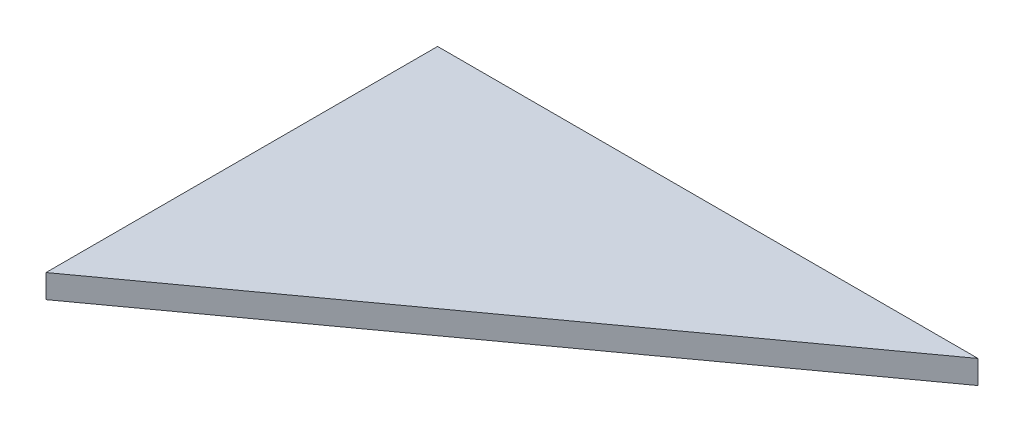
ISO-10303-21;
HEADER;
FILE_DESCRIPTION(('STEP AP214'),'2;1');
FILE_NAME('part.step','',(''),(''),'','','');
FILE_SCHEMA(('AUTOMOTIVE_DESIGN { 1 0 10303 214 1 1 1 1 }'));
ENDSEC;
DATA;
#1=APPLICATION_CONTEXT('core data for automotive mechanical design processes');
#2=APPLICATION_PROTOCOL_DEFINITION('international standard','automotive_design',2000,#1);
#3=PRODUCT_CONTEXT('',#1,'mechanical');
#4=PRODUCT('Part','Part','',(#3));
#5=PRODUCT_RELATED_PRODUCT_CATEGORY('part','',(#4));
#6=PRODUCT_DEFINITION_FORMATION('','',#4);
#7=PRODUCT_DEFINITION_CONTEXT('part definition',#1,'design');
#8=PRODUCT_DEFINITION('design','',#6,#7);
#9=PRODUCT_DEFINITION_SHAPE('','',#8);
#10=(LENGTH_UNIT() NAMED_UNIT(*) SI_UNIT(.MILLI.,.METRE.));
#11=(NAMED_UNIT(*) PLANE_ANGLE_UNIT() SI_UNIT($,.RADIAN.));
#12=(NAMED_UNIT(*) SI_UNIT($,.STERADIAN.) SOLID_ANGLE_UNIT());
#13=UNCERTAINTY_MEASURE_WITH_UNIT(LENGTH_MEASURE(1.E-05),#10,'distance_accuracy_value','');
#14=(GEOMETRIC_REPRESENTATION_CONTEXT(3) GLOBAL_UNCERTAINTY_ASSIGNED_CONTEXT((#13)) GLOBAL_UNIT_ASSIGNED_CONTEXT((#10,
#11,#12)) REPRESENTATION_CONTEXT('',''));
#15=CARTESIAN_POINT('',(0.,0.,0.));
#16=DIRECTION('',(0.,0.,1.));
#17=DIRECTION('',(1.,0.,0.));
#18=AXIS2_PLACEMENT_3D('',#15,#16,#17);
#19=CARTESIAN_POINT('',(69.,3.,0.));
#20=DIRECTION('',(0.,0.,1.));
#21=DIRECTION('',(1.,0.,0.));
#22=AXIS2_PLACEMENT_3D('',#19,#20,#21);
#23=PLANE('',#22);
#24=DIRECTION('',(-1.,0.,0.));
#25=VECTOR('',#24,1.);
#26=CARTESIAN_POINT('',(69.,0.,0.));
#27=LINE('',#26,#25);
#28=CARTESIAN_POINT('',(69.,0.,0.));
#29=VERTEX_POINT('',#28);
#30=CARTESIAN_POINT('',(0.,0.,0.));
#31=VERTEX_POINT('',#30);
#32=EDGE_CURVE('E66',#29,#31,#27,.T.);
#33=ORIENTED_EDGE('',*,*,#32,.T.);
#34=DIRECTION('',(0.,-1.,0.));
#35=VECTOR('',#34,1.);
#36=CARTESIAN_POINT('',(0.,3.,0.));
#37=LINE('',#36,#35);
#38=CARTESIAN_POINT('',(0.,3.,0.));
#39=VERTEX_POINT('',#38);
#40=EDGE_CURVE('E11',#39,#31,#37,.T.);
#41=ORIENTED_EDGE('',*,*,#40,.F.);
#42=DIRECTION('',(-1.,0.,0.));
#43=VECTOR('',#42,1.);
#44=CARTESIAN_POINT('',(69.,3.,0.));
#45=LINE('',#44,#43);
#46=CARTESIAN_POINT('',(69.,3.,0.));
#47=VERTEX_POINT('',#46);
#48=EDGE_CURVE('E80',#47,#39,#45,.T.);
#49=ORIENTED_EDGE('',*,*,#48,.F.);
#50=DIRECTION('',(0.,-1.,0.));
#51=VECTOR('',#50,1.);
#52=CARTESIAN_POINT('',(69.,3.,0.));
#53=LINE('',#52,#51);
#54=EDGE_CURVE('E76',#47,#29,#53,.T.);
#55=ORIENTED_EDGE('',*,*,#54,.T.);
#56=EDGE_LOOP('',(#33,#41,#49,#55));
#57=FACE_BOUND('',#56,.T.);
#58=ADVANCED_FACE('F30',(#57),#23,.F.);
#59=CARTESIAN_POINT('',(0.,3.,0.));
#60=DIRECTION('',(1.,0.,0.));
#61=DIRECTION('',(0.,0.,-1.));
#62=AXIS2_PLACEMENT_3D('',#59,#60,#61);
#63=PLANE('',#62);
#64=DIRECTION('',(0.,0.,1.));
#65=VECTOR('',#64,1.);
#66=CARTESIAN_POINT('',(0.,0.,0.));
#67=LINE('',#66,#65);
#68=CARTESIAN_POINT('',(0.,0.,50.));
#69=VERTEX_POINT('',#68);
#70=EDGE_CURVE('E63',#31,#69,#67,.T.);
#71=ORIENTED_EDGE('',*,*,#70,.T.);
#72=DIRECTION('',(0.,-1.,0.));
#73=VECTOR('',#72,1.);
#74=CARTESIAN_POINT('',(0.,3.,50.));
#75=LINE('',#74,#73);
#76=CARTESIAN_POINT('',(0.,3.,50.));
#77=VERTEX_POINT('',#76);
#78=EDGE_CURVE('E37',#77,#69,#75,.T.);
#79=ORIENTED_EDGE('',*,*,#78,.F.);
#80=DIRECTION('',(0.,0.,1.));
#81=VECTOR('',#80,1.);
#82=CARTESIAN_POINT('',(0.,3.,0.));
#83=LINE('',#82,#81);
#84=EDGE_CURVE('E48',#39,#77,#83,.T.);
#85=ORIENTED_EDGE('',*,*,#84,.F.);
#86=ORIENTED_EDGE('',*,*,#40,.T.);
#87=EDGE_LOOP('',(#71,#79,#85,#86));
#88=FACE_BOUND('',#87,.T.);
#89=ADVANCED_FACE('F72',(#88),#63,.F.);
#90=CARTESIAN_POINT('',(0.,3.,50.));
#91=DIRECTION('',(-0.586775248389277,0.,-0.809749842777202));
#92=DIRECTION('',(-0.809749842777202,0.,0.586775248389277));
#93=AXIS2_PLACEMENT_3D('',#90,#91,#92);
#94=PLANE('',#93);
#95=DIRECTION('',(0.809749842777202,0.,-0.586775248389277));
#96=VECTOR('',#95,1.);
#97=CARTESIAN_POINT('',(0.,0.,50.));
#98=LINE('',#97,#96);
#99=EDGE_CURVE('E67',#69,#29,#98,.T.);
#100=ORIENTED_EDGE('',*,*,#99,.T.);
#101=ORIENTED_EDGE('',*,*,#54,.F.);
#102=DIRECTION('',(0.809749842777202,0.,-0.586775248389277));
#103=VECTOR('',#102,1.);
#104=CARTESIAN_POINT('',(0.,3.,50.));
#105=LINE('',#104,#103);
#106=EDGE_CURVE('E44',#77,#47,#105,.T.);
#107=ORIENTED_EDGE('',*,*,#106,.F.);
#108=ORIENTED_EDGE('',*,*,#78,.T.);
#109=EDGE_LOOP('',(#100,#101,#107,#108));
#110=FACE_BOUND('',#109,.T.);
#111=ADVANCED_FACE('F85',(#110),#94,.F.);
#112=CARTESIAN_POINT('',(0.,3.,0.));
#113=DIRECTION('',(0.,1.,0.));
#114=DIRECTION('',(0.,0.,1.));
#115=AXIS2_PLACEMENT_3D('',#112,#113,#114);
#116=PLANE('',#115);
#117=ORIENTED_EDGE('',*,*,#48,.T.);
#118=ORIENTED_EDGE('',*,*,#84,.T.);
#119=ORIENTED_EDGE('',*,*,#106,.T.);
#120=EDGE_LOOP('',(#117,#118,#119));
#121=FACE_BOUND('',#120,.T.);
#122=ADVANCED_FACE('F86',(#121),#116,.T.);
#123=CARTESIAN_POINT('',(0.,0.,0.));
#124=DIRECTION('',(0.,1.,0.));
#125=DIRECTION('',(0.,0.,1.));
#126=AXIS2_PLACEMENT_3D('',#123,#124,#125);
#127=PLANE('',#126);
#128=ORIENTED_EDGE('',*,*,#32,.F.);
#129=ORIENTED_EDGE('',*,*,#99,.F.);
#130=ORIENTED_EDGE('',*,*,#70,.F.);
#131=EDGE_LOOP('',(#128,#129,#130));
#132=FACE_BOUND('',#131,.T.);
#133=ADVANCED_FACE('F64',(#132),#127,.F.);
#134=CLOSED_SHELL('',(#58,#89,#111,#122,#133));
#135=MANIFOLD_SOLID_BREP('B2',#134);
#136=ADVANCED_BREP_SHAPE_REPRESENTATION('',(#18,#135),#14);
#137=SHAPE_DEFINITION_REPRESENTATION(#9,#136);
ENDSEC;
END-ISO-10303-21;
